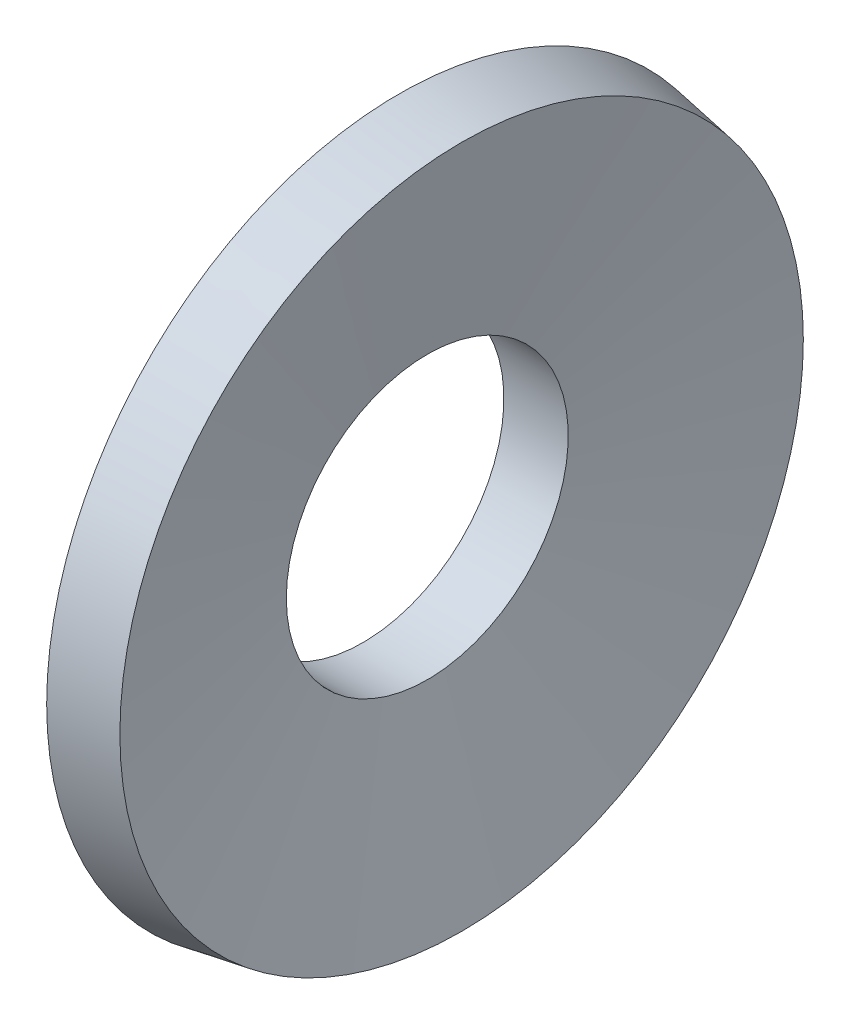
from build123d import *


with BuildPart() as part:
    # Esquisse1 → Base-R_volution (revolve)
    with BuildSketch(Plane(origin=(0, 0, 0), x_dir=(1, 0, 0), z_dir=(0, 1, 0)), mode=Mode.PRIVATE) as base_r_volution_sk:
        Polygon((0, 2), (0.512870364, 5), (1.4, 4.848339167), (0.913057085, 2), align=None)
    revolve(base_r_volution_sk.sketch.rotate(Axis((0, 0, 0), (1, 0, 0)), 180), axis=Axis((0, 0, 0), (1, 0, 0)))


solid = part.part
